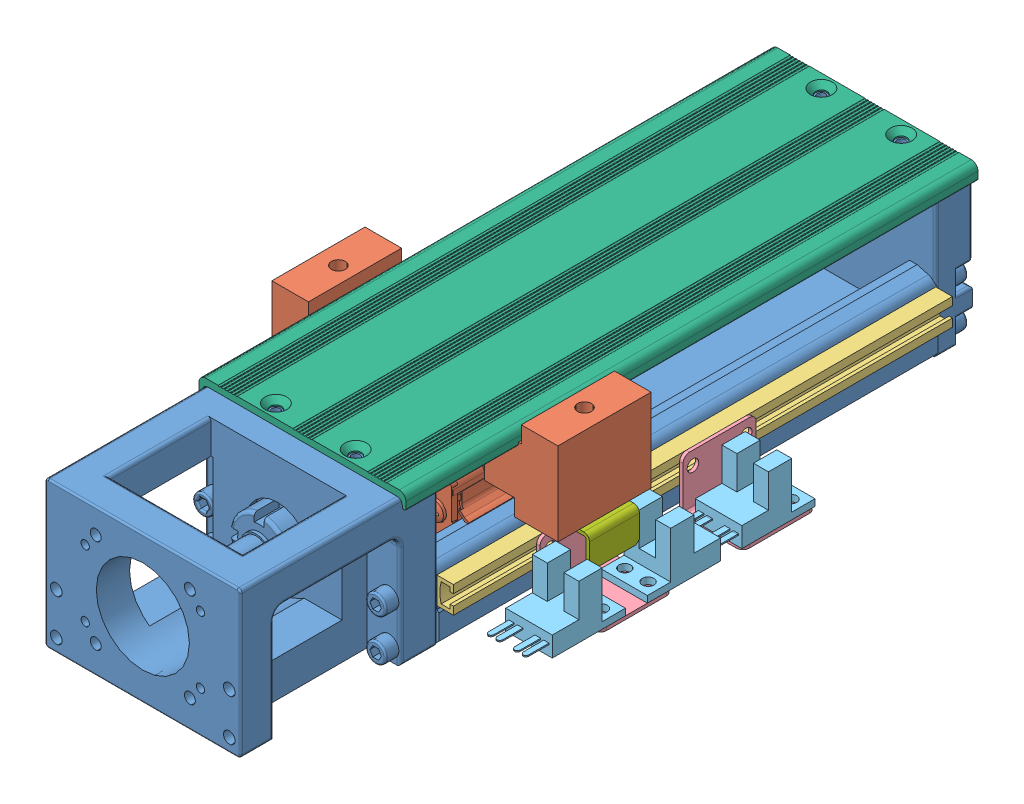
SolidWorks assembly TPK60-S2-F0C.SLDASM, configuration 150 (file format 13000). Lengths in mm.
Overall size (96.4 48 220).
12 component instances, 7 part files, 24 mates.
Components (placement in the parent):
- TPK60-F0-1: TPK60-F0.SLDPRT [150] at (-61.6509 -8.4235 196) size (60 44.5 220)
- TPK60C-S1-C-1: TPK60C-S1-C.SLDPRT [默认] at (-37.231 -44.6252 230.0061) x (-1 0 0) z (0 1 0) size (86 60.9 36)
- 极限轨道与开关固定座组合-1: 极限轨道与开关固定座组合.SLDASM [150] at (1.4538 4.6637 46) x (0 -1 0) z (0 0 1) size (16 24 150)
  - TPK60-LR 极限轨道-1: TPK60-LR 极限轨道.SLDPRT [150] at (-2.8111 1.1304 150) size (8 5 150)
  - 开关固定座：KK-674S2-F-1: 开关固定座：KK-674S2-F.SLDPRT [默认] at (8.1889 4.6304 189) x (0 1 0) z (0 0 1) size (19 16 22)
  - 开关固定座：KK-674S2-F-2: 开关固定座：KK-674S2-F.SLDPRT [默认] at (8.1889 4.6304 146) x (0 1 0) z (0 0 1) size (19 16 22)
- SX674光电开关-1: SX674光电开关.SLDPRT [默认] at (17.0842 -3.5252 238.3) size (14 16 28.99)
- SX674光电开关-2: SX674光电开关.SLDPRT [默认] at (17.0842 -3.5252 231.7) x (-1 0 0) z (0 0 -1) size (14 16 28.99)
- SX674光电开关-3: SX674光电开关.SLDPRT [默认] at (17.0842 -3.5252 181.3) size (14 16 28.99)
- TPK-60-CU-1: TPK-60-CU.SLDPRT [150] at (-61.449 33.2128 196) size (62.2 4.5 172)
- 带盖挡光片：KK-60-S2-D1-1: 带盖挡光片：KK-60-S2-D1.SLDPRT [默认] at (-29.3158 -7.5252 130.5) size (12.5 13.85 15)
- TPK60C-S1-C-2: TPK60C-S1-C.SLDPRT [默认] at (-37.231 -44.6252 176.0061) x (-1 0 0) z (0 1 0) size (86 60.9 36) (suppressed, hidden)
Mates (geometry in assembly coordinates):
- 同心1: concentric aligned: cylinder of TPK60-F0-1 through (-29.3158 15.4748 104.0294) axis (0 0 1) radius 6; cylinder of TPK60C-S1-C-1 through (-29.3158 15.4748 210.4) axis (0 0 1) radius 6.6
- 平行1: parallel anti-aligned: plane of TPK60-F0-1 through (-5.8158 -7.5252 271) normal (0 -1 0); plane of TPK60C-S1-C-1 through (2.6842 35.4748 220.2) normal (0 1 0)
- 150: limit distance anti-aligned: plane of TPK60C-S1-C-1 through (-17.8158 9.4748 264) normal (0 0 1); plane of TPK60-F0-1 through (-16.3254 7.9748 264) normal (0 0 -1)
- 200: limit distance: plane of TPK60C-S1-C-1 through (-17.8158 9.4748 264) normal (0 0 1); plane of TPK60-F0-1 through (-16.3254 7.9748 264) normal (0 0 -1)
- 300: limit distance: plane of TPK60-F0-1 through (-16.3254 7.9748 264) normal (0 0 -1); plane of TPK60C-S1-C-1 through (-17.8158 9.4748 264) normal (0 0 1)
- 400: limit distance: plane of TPK60-F0-1 through (-16.3254 7.9748 264) normal (0 0 -1); plane of TPK60C-S1-C-1 through (-17.8158 9.4748 264) normal (0 0 1)
- 500: limit distance: plane of TPK60C-S1-C-1 through (-17.8158 9.4748 264) normal (0 0 1); plane of TPK60-F0-1 through (-16.3254 7.9748 264) normal (0 0 -1)
- 600: limit distance: plane of TPK60C-S1-C-1 through (-17.8158 9.4748 264) normal (0 0 1); plane of TPK60-F0-1 through (-16.3254 7.9748 264) normal (0 0 -1)
- 重合2: coincident anti-aligned: plane of TPK60-F0-1 through (0.0842 7.9331 271) normal (1 0 0); plane of 极限轨道与开关固定座组合-1/TPK60-LR 极限轨道-1 through (0.0842 11.4748 271) normal (-1 0 0)
- 同心3: concentric anti-aligned: cylinder of TPK60-F0-1 through (0.0842 7.4748 246) axis (1 0 0) radius 1.025; cylinder of 极限轨道与开关固定座组合-1/TPK60-LR 极限轨道-1 through (5.0842 7.4748 246) axis (-1 0 0) radius 1.5
- 重合5: coincident anti-aligned: plane of 极限轨道与开关固定座组合-1/开关固定座：KK-674S2-F-1 through (6.0842 -3.5252 246) normal (0 1 0); plane of SX674光电开关-1 through (10.0842 -3.5252 260.3) normal (0 -1 0)
- 同心5: concentric aligned: cylinder of 极限轨道与开关固定座组合-1/开关固定座：KK-674S2-F-1 through (20.5842 -3.5252 242) axis (0 1 0) radius 1.25; cylinder of SX674光电开关-1 through (20.5842 -16.5252 242) axis (0 1 0) radius 1.75
- 同心7: concentric aligned: cylinder of 极限轨道与开关固定座组合-1/开关固定座：KK-674S2-F-1 through (20.5842 -3.5252 228) axis (0 1 0) radius 1.25; cylinder of SX674光电开关-2 through (20.5842 -16.5252 228) axis (0 1 0) radius 1.75
- 同心8: concentric aligned: cylinder of 极限轨道与开关固定座组合-1/开关固定座：KK-674S2-F-1 through (13.5842 -3.5252 228) axis (0 1 0) radius 1.25; cylinder of SX674光电开关-2 through (13.5842 -16.5252 228) axis (0 1 0) radius 1.75
- 重合6: coincident aligned: plane of SX674光电开关-1 through (10.0842 -1.5252 245.3) normal (0 1 0); plane of SX674光电开关-2 through (24.0842 -1.5252 224.7) normal (0 1 0)
- 同心9: concentric aligned: cylinder of 极限轨道与开关固定座组合-1/开关固定座：KK-674S2-F-2 through (13.5842 -3.5252 185) axis (0 1 0) radius 1.25; cylinder of SX674光电开关-3 through (13.5842 -16.5252 185) axis (0 1 0) radius 1.75
- 重合7: coincident anti-aligned: plane of 极限轨道与开关固定座组合-1/开关固定座：KK-674S2-F-2 through (6.0842 -3.5252 203) normal (0 1 0); plane of SX674光电开关-3 through (10.0842 -3.5252 203.3) normal (0 -1 0)
- 平行3: parallel aligned: plane of TPK60-F0-1 through (-5.8158 -7.5252 271) normal (0 -1 0); plane of 极限轨道与开关固定座组合-1/TPK60-LR 极限轨道-1 through (0.0842 3.4748 271) normal (0 -1 0)
- 重合8: coincident anti-aligned: plane of TPK60-F0-1 through (-58.7158 36.9748 330) normal (0 1 0); plane of TPK-60-CU-1 through (-57.8158 36.9748 282) normal (0 -1 0)
- 同心10: concentric aligned: cylinder of TPK60-F0-1 through (-17.3158 36.9748 278) axis (0 1 0) radius 1.25; cylinder of TPK-60-CU-1 through (-17.3158 38.9748 278) axis (0 1 0) radius 1.7
- 同心11: concentric aligned: cylinder of TPK60-F0-1 through (-41.3158 36.9748 278) axis (0 1 0) radius 1.25; cylinder of TPK-60-CU-1 through (-41.3158 38.9748 278) axis (0 1 0) radius 1.7
- 同心12: concentric anti-aligned: cylinder of TPK60C-S1-C-1 through (7.6842 15.4748 238.2) axis (0 -1 0) radius 1.25; cylinder of 带盖挡光片：KK-60-S2-D1-1 through (7.6842 18.3406 238.2) axis (0 1 0) radius 1.5
- 同心13: concentric anti-aligned: circle of TPK60C-S1-C-1; cylinder of 带盖挡光片：KK-60-S2-D1-1 through (7.6842 18.3406 230.2) axis (0 1 0) radius 1.5
- 重合9: coincident anti-aligned: plane of TPK60C-S1-C-1 through (0.6842 15.4748 220.2) normal (0 -1 0); plane of 带盖挡光片：KK-60-S2-D1-1 through (16.6842 15.4748 226.7) normal (0 1 0)
